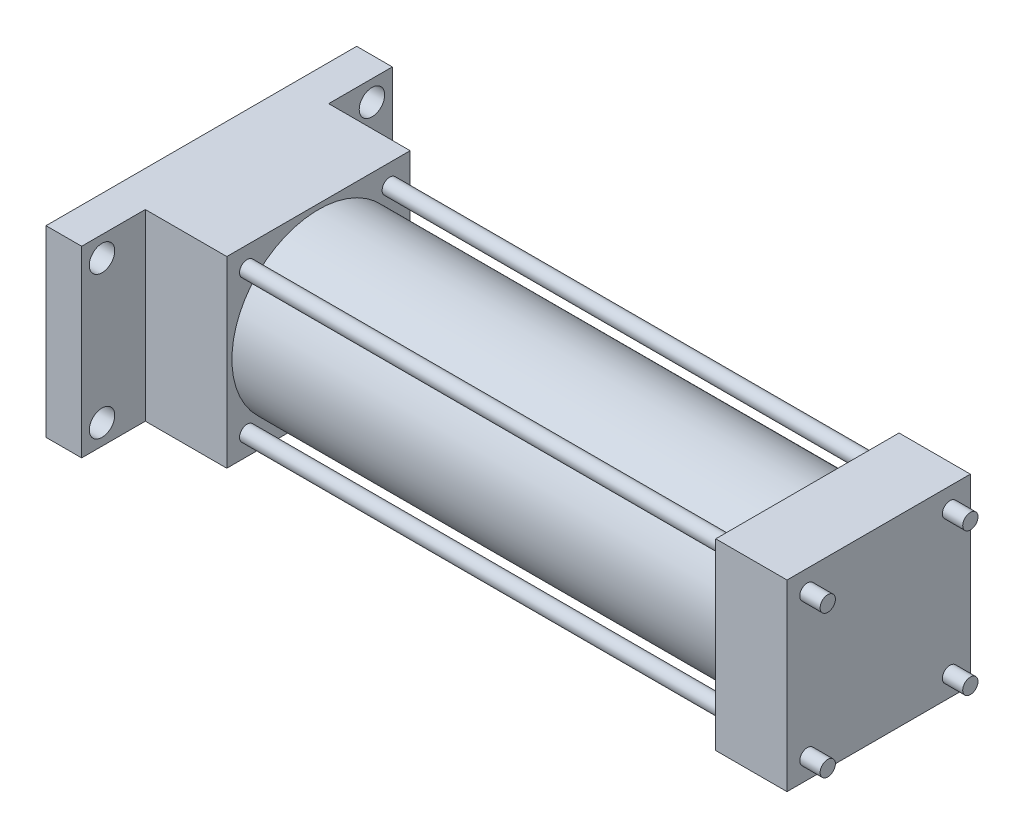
from build123d import *

# Parameters (mm, degrees)
SKETCH1_W            = 114.3
SKETCH1_H            = 114.3
BASE_EXTRUDE_DEPTH   = 44.45
SKETCH2_R            = 53.975
BOSS_EXTRUDE1_DEPTH  = 304.8
SKETCH3_W            = 114.3
SKETCH3_H            = 114.3
BOSS_EXTRUDE2_DEPTH  = 73.025
SKETCH4_R            = 25.4
BOSS_EXTRUDE3_DEPTH  = 25.4
CUT_EXTRUDE1_START   = -403.225
SKETCH5_R            = 17.4625
CUT_EXTRUDE1_DEPTH   = 403.225
SKETCH6_R            = 4.7625
BOSS_EXTRUDE4_DEPTH  = 361.95
SKETCH7_W            = 193.675
SKETCH7_H            = 114.3
BOSS_EXTRUDE5_DEPTH  = 22.225
CUT_EXTRUDE2_REACH   = 451.274
SKETCH8_R            = 7.9375
LPATTERN2_COUNT      = 2
LPATTERN2_PITCH      = 168.275
LPATTERN2_COUNT_DIR2 = 2
LPATTERN2_PITCH_DIR2 = 88.9


with BuildPart() as part:
    # Sketch1 → Base-Extrude (new body)
    with BuildSketch(Plane(origin=(0, 0, 0), x_dir=(0, 0, -1), z_dir=(1, 0, 0))):
        Rectangle(SKETCH1_W, SKETCH1_H)
    extrude(amount=-BASE_EXTRUDE_DEPTH)

    # Sketch2 → Boss-Extrude1 (add)
    with BuildSketch(Plane.ZY.offset(44.45)):
        with Locations(Location((0, 0, 0), (0, 0, 180))):
            Circle(SKETCH2_R)
    extrude(amount=BOSS_EXTRUDE1_DEPTH)

    # Sketch3 → Boss-Extrude2 (add)
    with BuildSketch(Plane.ZY.offset(349.25)):
        Rectangle(SKETCH3_W, SKETCH3_H)
    extrude(amount=BOSS_EXTRUDE2_DEPTH)

    # Sketch4 → Boss-Extrude3 (add)
    with BuildSketch(Plane.ZY.offset(422.275)):
        with Locations(Location((0, 0, 0), (0, 0, 180))):
            Circle(SKETCH4_R)
    extrude(amount=BOSS_EXTRUDE3_DEPTH)

    # Sketch5 → Cut-Extrude1 (cut)
    with BuildSketch(Plane.ZY.offset(447.675).offset(CUT_EXTRUDE1_START)):
        Circle(SKETCH5_R)
    extrude(amount=CUT_EXTRUDE1_DEPTH, mode=Mode.SUBTRACT)

    # Sketch6 → Boss-Extrude4 (add)
    with BuildSketch(Plane(origin=(-349.25, 0, 0), x_dir=(0, 0, -1), z_dir=(1, 0, 0))):
        with Locations(Location((-44.45, 44.45, 0), (0, 0, 180))):
            Circle(SKETCH6_R)
        with Locations(Location((44.45, 44.45, 0), (0, 0, 180))):
            Circle(SKETCH6_R)
        with Locations(Location((44.45, -44.45, 0), (0, 0, 180))):
            Circle(SKETCH6_R)
        with Locations(Location((-44.45, -44.45, 0), (0, 0, 180))):
            Circle(SKETCH6_R)
    extrude(amount=BOSS_EXTRUDE4_DEPTH)

    # Sketch7 → Boss-Extrude5 (add)
    with BuildSketch(Plane.ZY.offset(422.275)):
        Rectangle(SKETCH7_W, SKETCH7_H)
    extrude(amount=-BOSS_EXTRUDE5_DEPTH)

    # Sketch8 → Cut-Extrude2 (cut, up to next)
    with BuildSketch(Plane.ZY.offset(422.275), mode=Mode.PRIVATE) as cut_extrude2_sk1:
        with Locations((84.1375, -44.45)):
            Circle(SKETCH8_R)
    cut_extrude2_tool1 = extrude(cut_extrude2_sk1.sketch, amount=-CUT_EXTRUDE2_REACH, mode=Mode.PRIVATE) & part.part
    cut_extrude2 = cut_extrude2_tool1.solids().sort_by_distance((-422.275, -44.45, 84.1375))[0]
    add(cut_extrude2, mode=Mode.SUBTRACT)

    # LPattern2: Cut-Extrude2 2 × 2
    with Locations(*[(0, j * LPATTERN2_PITCH_DIR2, -i * LPATTERN2_PITCH) for i in range(LPATTERN2_COUNT) for j in range(LPATTERN2_COUNT_DIR2) if (i, j) != (0, 0)]):
        add(cut_extrude2, mode=Mode.SUBTRACT)


solid = part.part
